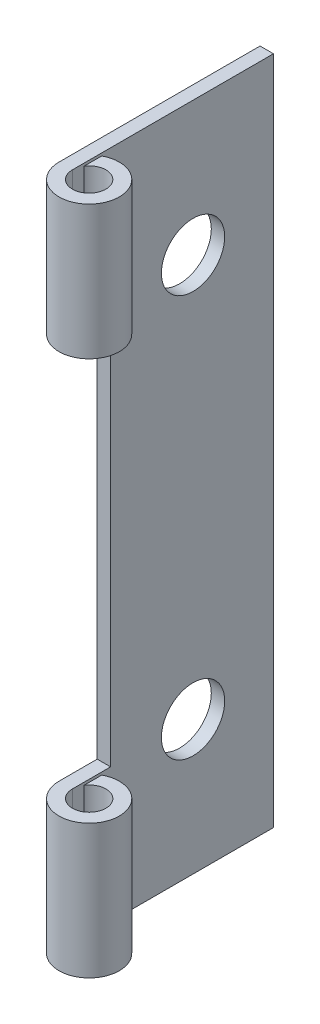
ISO-10303-21;
HEADER;
FILE_DESCRIPTION(('STEP AP214'),'2;1');
FILE_NAME('part.step','',(''),(''),'','','');
FILE_SCHEMA(('AUTOMOTIVE_DESIGN { 1 0 10303 214 1 1 1 1 }'));
ENDSEC;
DATA;
#1=APPLICATION_CONTEXT('core data for automotive mechanical design processes');
#2=APPLICATION_PROTOCOL_DEFINITION('international standard','automotive_design',2000,#1);
#3=PRODUCT_CONTEXT('',#1,'mechanical');
#4=PRODUCT('Part','Part','',(#3));
#5=PRODUCT_RELATED_PRODUCT_CATEGORY('part','',(#4));
#6=PRODUCT_DEFINITION_FORMATION('','',#4);
#7=PRODUCT_DEFINITION_CONTEXT('part definition',#1,'design');
#8=PRODUCT_DEFINITION('design','',#6,#7);
#9=PRODUCT_DEFINITION_SHAPE('','',#8);
#10=(LENGTH_UNIT() NAMED_UNIT(*) SI_UNIT(.MILLI.,.METRE.));
#11=(NAMED_UNIT(*) PLANE_ANGLE_UNIT() SI_UNIT($,.RADIAN.));
#12=(NAMED_UNIT(*) SI_UNIT($,.STERADIAN.) SOLID_ANGLE_UNIT());
#13=UNCERTAINTY_MEASURE_WITH_UNIT(LENGTH_MEASURE(1.E-05),#10,'distance_accuracy_value','');
#14=(GEOMETRIC_REPRESENTATION_CONTEXT(3) GLOBAL_UNCERTAINTY_ASSIGNED_CONTEXT((#13)) GLOBAL_UNIT_ASSIGNED_CONTEXT((#10,
#11,#12)) REPRESENTATION_CONTEXT('',''));
#15=CARTESIAN_POINT('',(0.,0.,0.));
#16=DIRECTION('',(0.,0.,1.));
#17=DIRECTION('',(1.,0.,0.));
#18=AXIS2_PLACEMENT_3D('',#15,#16,#17);
#19=CARTESIAN_POINT('',(0.635,31.75,-9.525));
#20=DIRECTION('',(-1.,0.,0.));
#21=DIRECTION('',(0.,0.,1.));
#22=AXIS2_PLACEMENT_3D('',#19,#20,#21);
#23=PLANE('',#22);
#24=CARTESIAN_POINT('',(0.635,6.35,-5.715));
#25=DIRECTION('',(1.,0.,0.));
#26=DIRECTION('',(0.,0.,-1.));
#27=AXIS2_PLACEMENT_3D('',#24,#25,#26);
#28=CIRCLE('',#27,1.5);
#29=CARTESIAN_POINT('',(0.635,6.35,-7.215));
#30=VERTEX_POINT('',#29);
#31=EDGE_CURVE('E226',#30,#30,#28,.T.);
#32=ORIENTED_EDGE('',*,*,#31,.F.);
#33=EDGE_LOOP('',(#32));
#34=FACE_BOUND('',#33,.T.);
#35=CARTESIAN_POINT('',(0.635,25.4,-5.715));
#36=DIRECTION('',(1.,0.,0.));
#37=DIRECTION('',(0.,0.,-1.));
#38=AXIS2_PLACEMENT_3D('',#35,#36,#37);
#39=CIRCLE('',#38,1.5);
#40=CARTESIAN_POINT('',(0.635,25.4,-7.215));
#41=VERTEX_POINT('',#40);
#42=EDGE_CURVE('E221',#41,#41,#39,.T.);
#43=ORIENTED_EDGE('',*,*,#42,.F.);
#44=EDGE_LOOP('',(#43));
#45=FACE_BOUND('',#44,.T.);
#46=DIRECTION('',(0.,0.,1.));
#47=VECTOR('',#46,1.);
#48=CARTESIAN_POINT('',(0.635,25.4,-9.525));
#49=LINE('',#48,#47);
#50=CARTESIAN_POINT('',(0.635,25.4,-1.80975));
#51=VERTEX_POINT('',#50);
#52=CARTESIAN_POINT('',(0.635,25.4,0.));
#53=VERTEX_POINT('',#52);
#54=EDGE_CURVE('E61',#51,#53,#49,.T.);
#55=ORIENTED_EDGE('',*,*,#54,.F.);
#56=DIRECTION('',(0.,1.,0.));
#57=VECTOR('',#56,1.);
#58=CARTESIAN_POINT('',(0.635,31.75,-1.80975));
#59=LINE('',#58,#57);
#60=CARTESIAN_POINT('',(0.635,6.35,-1.80975));
#61=VERTEX_POINT('',#60);
#62=EDGE_CURVE('E149',#61,#51,#59,.T.);
#63=ORIENTED_EDGE('',*,*,#62,.F.);
#64=DIRECTION('',(0.,0.,-1.));
#65=VECTOR('',#64,1.);
#66=CARTESIAN_POINT('',(0.635,6.35,-9.52500000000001));
#67=LINE('',#66,#65);
#68=CARTESIAN_POINT('',(0.635,6.35,0.));
#69=VERTEX_POINT('',#68);
#70=EDGE_CURVE('E194',#69,#61,#67,.T.);
#71=ORIENTED_EDGE('',*,*,#70,.F.);
#72=DIRECTION('',(0.,-1.,0.));
#73=VECTOR('',#72,1.);
#74=CARTESIAN_POINT('',(0.635,31.75,0.));
#75=LINE('',#74,#73);
#76=CARTESIAN_POINT('',(0.635,0.,0.));
#77=VERTEX_POINT('',#76);
#78=EDGE_CURVE('E98',#69,#77,#75,.T.);
#79=ORIENTED_EDGE('',*,*,#78,.T.);
#80=DIRECTION('',(0.,0.,-1.));
#81=VECTOR('',#80,1.);
#82=CARTESIAN_POINT('',(0.635,0.,-9.525));
#83=LINE('',#82,#81);
#84=CARTESIAN_POINT('',(0.635,0.,-9.525));
#85=VERTEX_POINT('',#84);
#86=EDGE_CURVE('E145',#77,#85,#83,.T.);
#87=ORIENTED_EDGE('',*,*,#86,.T.);
#88=DIRECTION('',(0.,-1.,0.));
#89=VECTOR('',#88,1.);
#90=CARTESIAN_POINT('',(0.635,31.75,-9.525));
#91=LINE('',#90,#89);
#92=CARTESIAN_POINT('',(0.635,31.75,-9.525));
#93=VERTEX_POINT('',#92);
#94=EDGE_CURVE('E172',#93,#85,#91,.T.);
#95=ORIENTED_EDGE('',*,*,#94,.F.);
#96=DIRECTION('',(0.,0.,-1.));
#97=VECTOR('',#96,1.);
#98=CARTESIAN_POINT('',(0.635,31.75,-9.525));
#99=LINE('',#98,#97);
#100=CARTESIAN_POINT('',(0.635,31.75,0.));
#101=VERTEX_POINT('',#100);
#102=EDGE_CURVE('E104',#101,#93,#99,.T.);
#103=ORIENTED_EDGE('',*,*,#102,.F.);
#104=EDGE_CURVE('E162',#101,#53,#75,.T.);
#105=ORIENTED_EDGE('',*,*,#104,.T.);
#106=EDGE_LOOP('',(#55,#63,#71,#79,#87,#95,#103,#105));
#107=FACE_BOUND('',#106,.T.);
#108=ADVANCED_FACE('F47',(#34,#45,#107),#23,.F.);
#109=CARTESIAN_POINT('',(0.,31.75,-9.525));
#110=DIRECTION('',(1.,0.,0.));
#111=DIRECTION('',(0.,0.,-1.));
#112=AXIS2_PLACEMENT_3D('',#109,#110,#111);
#113=PLANE('',#112);
#114=CARTESIAN_POINT('',(0.,6.35,-5.715));
#115=DIRECTION('',(1.,0.,0.));
#116=DIRECTION('',(0.,0.,-1.));
#117=AXIS2_PLACEMENT_3D('',#114,#115,#116);
#118=CIRCLE('',#117,1.5);
#119=CARTESIAN_POINT('',(0.,6.35,-7.215));
#120=VERTEX_POINT('',#119);
#121=EDGE_CURVE('E211',#120,#120,#118,.T.);
#122=ORIENTED_EDGE('',*,*,#121,.T.);
#123=EDGE_LOOP('',(#122));
#124=FACE_BOUND('',#123,.T.);
#125=CARTESIAN_POINT('',(0.,25.4,-5.715));
#126=DIRECTION('',(1.,0.,0.));
#127=DIRECTION('',(0.,0.,-1.));
#128=AXIS2_PLACEMENT_3D('',#125,#126,#127);
#129=CIRCLE('',#128,1.5);
#130=CARTESIAN_POINT('',(0.,25.4,-7.215));
#131=VERTEX_POINT('',#130);
#132=EDGE_CURVE('E219',#131,#131,#129,.T.);
#133=ORIENTED_EDGE('',*,*,#132,.T.);
#134=EDGE_LOOP('',(#133));
#135=FACE_BOUND('',#134,.T.);
#136=DIRECTION('',(0.,1.,0.));
#137=VECTOR('',#136,1.);
#138=CARTESIAN_POINT('',(0.,12.7,-1.80975));
#139=LINE('',#138,#137);
#140=CARTESIAN_POINT('',(0.,6.35,-1.80975));
#141=VERTEX_POINT('',#140);
#142=CARTESIAN_POINT('',(0.,25.4,-1.80975));
#143=VERTEX_POINT('',#142);
#144=EDGE_CURVE('E214',#141,#143,#139,.T.);
#145=ORIENTED_EDGE('',*,*,#144,.T.);
#146=DIRECTION('',(0.,0.,1.));
#147=VECTOR('',#146,1.);
#148=CARTESIAN_POINT('',(0.,25.4,1.80975));
#149=LINE('',#148,#147);
#150=CARTESIAN_POINT('',(0.,25.4,0.));
#151=VERTEX_POINT('',#150);
#152=EDGE_CURVE('E208',#143,#151,#149,.T.);
#153=ORIENTED_EDGE('',*,*,#152,.T.);
#154=DIRECTION('',(0.,-1.,0.));
#155=VECTOR('',#154,1.);
#156=CARTESIAN_POINT('',(0.,31.75,0.));
#157=LINE('',#156,#155);
#158=CARTESIAN_POINT('',(0.,31.75,0.));
#159=VERTEX_POINT('',#158);
#160=EDGE_CURVE('E167',#159,#151,#157,.T.);
#161=ORIENTED_EDGE('',*,*,#160,.F.);
#162=DIRECTION('',(0.,0.,1.));
#163=VECTOR('',#162,1.);
#164=CARTESIAN_POINT('',(0.,31.75,-9.525));
#165=LINE('',#164,#163);
#166=CARTESIAN_POINT('',(0.,31.75,-9.525));
#167=VERTEX_POINT('',#166);
#168=EDGE_CURVE('E121',#167,#159,#165,.T.);
#169=ORIENTED_EDGE('',*,*,#168,.F.);
#170=DIRECTION('',(0.,-1.,0.));
#171=VECTOR('',#170,1.);
#172=CARTESIAN_POINT('',(0.,31.75,-9.525));
#173=LINE('',#172,#171);
#174=CARTESIAN_POINT('',(0.,0.,-9.525));
#175=VERTEX_POINT('',#174);
#176=EDGE_CURVE('E169',#167,#175,#173,.T.);
#177=ORIENTED_EDGE('',*,*,#176,.T.);
#178=DIRECTION('',(0.,0.,1.));
#179=VECTOR('',#178,1.);
#180=CARTESIAN_POINT('',(0.,0.,-9.525));
#181=LINE('',#180,#179);
#182=CARTESIAN_POINT('',(0.,0.,0.));
#183=VERTEX_POINT('',#182);
#184=EDGE_CURVE('E151',#175,#183,#181,.T.);
#185=ORIENTED_EDGE('',*,*,#184,.T.);
#186=CARTESIAN_POINT('',(0.,6.35,0.));
#187=VERTEX_POINT('',#186);
#188=EDGE_CURVE('E135',#187,#183,#157,.T.);
#189=ORIENTED_EDGE('',*,*,#188,.F.);
#190=DIRECTION('',(0.,0.,-1.));
#191=VECTOR('',#190,1.);
#192=CARTESIAN_POINT('',(0.,6.35,1.80975));
#193=LINE('',#192,#191);
#194=EDGE_CURVE('E207',#187,#141,#193,.T.);
#195=ORIENTED_EDGE('',*,*,#194,.T.);
#196=EDGE_LOOP('',(#145,#153,#161,#169,#177,#185,#189,#195));
#197=FACE_BOUND('',#196,.T.);
#198=ADVANCED_FACE('F234',(#124,#135,#197),#113,.F.);
#199=CARTESIAN_POINT('',(1.42875,31.75,0.));
#200=DIRECTION('',(0.,-1.,0.));
#201=DIRECTION('',(0.,0.,-1.));
#202=AXIS2_PLACEMENT_3D('',#199,#200,#201);
#203=CYLINDRICAL_SURFACE('',#202,1.42875);
#204=DIRECTION('',(0.,-1.,0.));
#205=VECTOR('',#204,1.);
#206=CARTESIAN_POINT('',(0.762,31.75,-1.26363404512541));
#207=LINE('',#206,#205);
#208=CARTESIAN_POINT('',(0.762000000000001,6.35,-1.26363404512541));
#209=VERTEX_POINT('',#208);
#210=CARTESIAN_POINT('',(0.762,0.,-1.26363404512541));
#211=VERTEX_POINT('',#210);
#212=EDGE_CURVE('E136',#209,#211,#207,.T.);
#213=ORIENTED_EDGE('',*,*,#212,.F.);
#214=CARTESIAN_POINT('',(1.42875,6.35,0.));
#215=DIRECTION('',(0.,1.,0.));
#216=DIRECTION('',(0.,0.,1.));
#217=AXIS2_PLACEMENT_3D('',#214,#215,#216);
#218=CIRCLE('',#217,1.42875);
#219=EDGE_CURVE('E193',#187,#209,#218,.T.);
#220=ORIENTED_EDGE('',*,*,#219,.F.);
#221=ORIENTED_EDGE('',*,*,#188,.T.);
#222=CARTESIAN_POINT('',(1.42875,0.,0.));
#223=DIRECTION('',(0.,1.,0.));
#224=DIRECTION('',(0.,0.,1.));
#225=AXIS2_PLACEMENT_3D('',#222,#223,#224);
#226=CIRCLE('',#225,1.42875);
#227=EDGE_CURVE('E154',#183,#211,#226,.T.);
#228=ORIENTED_EDGE('',*,*,#227,.T.);
#229=EDGE_LOOP('',(#213,#220,#221,#228));
#230=FACE_BOUND('',#229,.T.);
#231=ADVANCED_FACE('F280',(#230),#203,.T.);
#232=ORIENTED_EDGE('',*,*,#160,.T.);
#233=CARTESIAN_POINT('',(1.42875,25.4,0.));
#234=DIRECTION('',(0.,-1.,0.));
#235=DIRECTION('',(0.,0.,-1.));
#236=AXIS2_PLACEMENT_3D('',#233,#234,#235);
#237=CIRCLE('',#236,1.42875);
#238=CARTESIAN_POINT('',(0.762000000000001,25.4,-1.26363404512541));
#239=VERTEX_POINT('',#238);
#240=EDGE_CURVE('E132',#239,#151,#237,.T.);
#241=ORIENTED_EDGE('',*,*,#240,.F.);
#242=CARTESIAN_POINT('',(0.762,31.75,-1.26363404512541));
#243=VERTEX_POINT('',#242);
#244=EDGE_CURVE('E128',#243,#239,#207,.T.);
#245=ORIENTED_EDGE('',*,*,#244,.F.);
#246=CARTESIAN_POINT('',(1.42875,31.75,0.));
#247=DIRECTION('',(0.,1.,0.));
#248=DIRECTION('',(0.,0.,1.));
#249=AXIS2_PLACEMENT_3D('',#246,#247,#248);
#250=CIRCLE('',#249,1.42875);
#251=EDGE_CURVE('E114',#159,#243,#250,.T.);
#252=ORIENTED_EDGE('',*,*,#251,.F.);
#253=EDGE_LOOP('',(#232,#241,#245,#252));
#254=FACE_BOUND('',#253,.T.);
#255=ADVANCED_FACE('F129',(#254),#203,.T.);
#256=CARTESIAN_POINT('',(0.762000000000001,31.75,-1.26363404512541));
#257=DIRECTION('',(1.,0.,0.));
#258=DIRECTION('',(0.,0.,-1.));
#259=AXIS2_PLACEMENT_3D('',#256,#257,#258);
#260=PLANE('',#259);
#261=DIRECTION('',(0.,0.,1.));
#262=VECTOR('',#261,1.);
#263=CARTESIAN_POINT('',(0.762000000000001,6.35,-1.26363404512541));
#264=LINE('',#263,#262);
#265=CARTESIAN_POINT('',(0.762000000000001,6.35,-0.430677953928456));
#266=VERTEX_POINT('',#265);
#267=EDGE_CURVE('E197',#209,#266,#264,.T.);
#268=ORIENTED_EDGE('',*,*,#267,.F.);
#269=ORIENTED_EDGE('',*,*,#212,.T.);
#270=DIRECTION('',(0.,0.,1.));
#271=VECTOR('',#270,1.);
#272=CARTESIAN_POINT('',(0.762000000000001,0.,-1.26363404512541));
#273=LINE('',#272,#271);
#274=CARTESIAN_POINT('',(0.762000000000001,0.,-0.430677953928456));
#275=VERTEX_POINT('',#274);
#276=EDGE_CURVE('E157',#211,#275,#273,.T.);
#277=ORIENTED_EDGE('',*,*,#276,.T.);
#278=DIRECTION('',(0.,-1.,0.));
#279=VECTOR('',#278,1.);
#280=CARTESIAN_POINT('',(0.762000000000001,31.75,-0.430677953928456));
#281=LINE('',#280,#279);
#282=EDGE_CURVE('E165',#266,#275,#281,.T.);
#283=ORIENTED_EDGE('',*,*,#282,.F.);
#284=EDGE_LOOP('',(#268,#269,#277,#283));
#285=FACE_BOUND('',#284,.T.);
#286=ADVANCED_FACE('F276',(#285),#260,.F.);
#287=DIRECTION('',(0.,0.,-1.));
#288=VECTOR('',#287,1.);
#289=CARTESIAN_POINT('',(0.762000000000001,25.4,-1.26363404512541));
#290=LINE('',#289,#288);
#291=CARTESIAN_POINT('',(0.762000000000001,25.4,-0.430677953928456));
#292=VERTEX_POINT('',#291);
#293=EDGE_CURVE('E177',#292,#239,#290,.T.);
#294=ORIENTED_EDGE('',*,*,#293,.F.);
#295=CARTESIAN_POINT('',(0.762000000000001,31.75,-0.430677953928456));
#296=VERTEX_POINT('',#295);
#297=EDGE_CURVE('E140',#296,#292,#281,.T.);
#298=ORIENTED_EDGE('',*,*,#297,.F.);
#299=DIRECTION('',(0.,0.,1.));
#300=VECTOR('',#299,1.);
#301=CARTESIAN_POINT('',(0.762000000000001,31.75,-1.26363404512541));
#302=LINE('',#301,#300);
#303=EDGE_CURVE('E118',#243,#296,#302,.T.);
#304=ORIENTED_EDGE('',*,*,#303,.F.);
#305=ORIENTED_EDGE('',*,*,#244,.T.);
#306=EDGE_LOOP('',(#294,#298,#304,#305));
#307=FACE_BOUND('',#306,.T.);
#308=ADVANCED_FACE('F138',(#307),#260,.F.);
#309=CARTESIAN_POINT('',(1.42875,31.75,0.));
#310=DIRECTION('',(0.,-1.,0.));
#311=DIRECTION('',(0.,0.,-1.));
#312=AXIS2_PLACEMENT_3D('',#309,#310,#311);
#313=CYLINDRICAL_SURFACE('',#312,0.79375);
#314=CARTESIAN_POINT('',(1.42875,6.35,0.));
#315=DIRECTION('',(0.,1.,0.));
#316=DIRECTION('',(0.,0.,1.));
#317=AXIS2_PLACEMENT_3D('',#314,#315,#316);
#318=CIRCLE('',#317,0.79375);
#319=EDGE_CURVE('E12',#266,#69,#318,.F.);
#320=ORIENTED_EDGE('',*,*,#319,.F.);
#321=ORIENTED_EDGE('',*,*,#282,.T.);
#322=CARTESIAN_POINT('',(1.42875,0.,0.));
#323=DIRECTION('',(0.,-1.,0.));
#324=DIRECTION('',(0.,0.,1.));
#325=AXIS2_PLACEMENT_3D('',#322,#323,#324);
#326=CIRCLE('',#325,0.79375);
#327=EDGE_CURVE('E160',#275,#77,#326,.T.);
#328=ORIENTED_EDGE('',*,*,#327,.T.);
#329=ORIENTED_EDGE('',*,*,#78,.F.);
#330=EDGE_LOOP('',(#320,#321,#328,#329));
#331=FACE_BOUND('',#330,.T.);
#332=ADVANCED_FACE('F272',(#331),#313,.F.);
#333=CARTESIAN_POINT('',(1.42875,25.4,0.));
#334=DIRECTION('',(0.,-1.,0.));
#335=DIRECTION('',(0.,0.,-1.));
#336=AXIS2_PLACEMENT_3D('',#333,#334,#335);
#337=CIRCLE('',#336,0.79375);
#338=EDGE_CURVE('E54',#53,#292,#337,.F.);
#339=ORIENTED_EDGE('',*,*,#338,.F.);
#340=ORIENTED_EDGE('',*,*,#104,.F.);
#341=CARTESIAN_POINT('',(1.42875,31.75,0.));
#342=DIRECTION('',(0.,-1.,0.));
#343=DIRECTION('',(0.,0.,1.));
#344=AXIS2_PLACEMENT_3D('',#341,#342,#343);
#345=CIRCLE('',#344,0.79375);
#346=EDGE_CURVE('E70',#296,#101,#345,.T.);
#347=ORIENTED_EDGE('',*,*,#346,.F.);
#348=ORIENTED_EDGE('',*,*,#297,.T.);
#349=EDGE_LOOP('',(#339,#340,#347,#348));
#350=FACE_BOUND('',#349,.T.);
#351=ADVANCED_FACE('F183',(#350),#313,.F.);
#352=CARTESIAN_POINT('',(0.635,31.75,-9.525));
#353=DIRECTION('',(0.,0.,1.));
#354=DIRECTION('',(1.,0.,0.));
#355=AXIS2_PLACEMENT_3D('',#352,#353,#354);
#356=PLANE('',#355);
#357=DIRECTION('',(-1.,0.,0.));
#358=VECTOR('',#357,1.);
#359=CARTESIAN_POINT('',(0.635,0.,-9.525));
#360=LINE('',#359,#358);
#361=EDGE_CURVE('E148',#85,#175,#360,.T.);
#362=ORIENTED_EDGE('',*,*,#361,.T.);
#363=ORIENTED_EDGE('',*,*,#176,.F.);
#364=DIRECTION('',(-1.,0.,0.));
#365=VECTOR('',#364,1.);
#366=CARTESIAN_POINT('',(0.635,31.75,-9.525));
#367=LINE('',#366,#365);
#368=EDGE_CURVE('E186',#93,#167,#367,.T.);
#369=ORIENTED_EDGE('',*,*,#368,.F.);
#370=ORIENTED_EDGE('',*,*,#94,.T.);
#371=EDGE_LOOP('',(#362,#363,#369,#370));
#372=FACE_BOUND('',#371,.T.);
#373=ADVANCED_FACE('F268',(#372),#356,.F.);
#374=CARTESIAN_POINT('',(1.42875,31.75,0.));
#375=DIRECTION('',(0.,1.,0.));
#376=DIRECTION('',(0.,0.,1.));
#377=AXIS2_PLACEMENT_3D('',#374,#375,#376);
#378=PLANE('',#377);
#379=ORIENTED_EDGE('',*,*,#168,.T.);
#380=ORIENTED_EDGE('',*,*,#251,.T.);
#381=ORIENTED_EDGE('',*,*,#303,.T.);
#382=ORIENTED_EDGE('',*,*,#346,.T.);
#383=ORIENTED_EDGE('',*,*,#102,.T.);
#384=ORIENTED_EDGE('',*,*,#368,.T.);
#385=EDGE_LOOP('',(#379,#380,#381,#382,#383,#384));
#386=FACE_BOUND('',#385,.T.);
#387=ADVANCED_FACE('F116',(#386),#378,.T.);
#388=CARTESIAN_POINT('',(1.42875,0.,0.));
#389=DIRECTION('',(0.,1.,0.));
#390=DIRECTION('',(0.,0.,1.));
#391=AXIS2_PLACEMENT_3D('',#388,#389,#390);
#392=PLANE('',#391);
#393=ORIENTED_EDGE('',*,*,#86,.F.);
#394=ORIENTED_EDGE('',*,*,#327,.F.);
#395=ORIENTED_EDGE('',*,*,#276,.F.);
#396=ORIENTED_EDGE('',*,*,#227,.F.);
#397=ORIENTED_EDGE('',*,*,#184,.F.);
#398=ORIENTED_EDGE('',*,*,#361,.F.);
#399=EDGE_LOOP('',(#393,#394,#395,#396,#397,#398));
#400=FACE_BOUND('',#399,.T.);
#401=ADVANCED_FACE('F265',(#400),#392,.F.);
#402=CARTESIAN_POINT('',(2.8575,25.4,1.80975));
#403=DIRECTION('',(0.,-1.,0.));
#404=DIRECTION('',(0.,0.,-1.));
#405=AXIS2_PLACEMENT_3D('',#402,#403,#404);
#406=PLANE('',#405);
#407=ORIENTED_EDGE('',*,*,#54,.T.);
#408=ORIENTED_EDGE('',*,*,#338,.T.);
#409=ORIENTED_EDGE('',*,*,#293,.T.);
#410=ORIENTED_EDGE('',*,*,#240,.T.);
#411=ORIENTED_EDGE('',*,*,#152,.F.);
#412=DIRECTION('',(-1.,0.,0.));
#413=VECTOR('',#412,1.);
#414=CARTESIAN_POINT('',(2.8575,25.4,-1.80975));
#415=LINE('',#414,#413);
#416=EDGE_CURVE('E204',#51,#143,#415,.T.);
#417=ORIENTED_EDGE('',*,*,#416,.F.);
#418=EDGE_LOOP('',(#407,#408,#409,#410,#411,#417));
#419=FACE_BOUND('',#418,.T.);
#420=ADVANCED_FACE('F176',(#419),#406,.T.);
#421=CARTESIAN_POINT('',(2.8575,12.7,-1.80975));
#422=DIRECTION('',(0.,0.,1.));
#423=DIRECTION('',(0.,-1.,0.));
#424=AXIS2_PLACEMENT_3D('',#421,#422,#423);
#425=PLANE('',#424);
#426=ORIENTED_EDGE('',*,*,#62,.T.);
#427=ORIENTED_EDGE('',*,*,#416,.T.);
#428=ORIENTED_EDGE('',*,*,#144,.F.);
#429=DIRECTION('',(-1.,0.,0.));
#430=VECTOR('',#429,1.);
#431=CARTESIAN_POINT('',(2.8575,6.35,-1.80975));
#432=LINE('',#431,#430);
#433=EDGE_CURVE('E181',#61,#141,#432,.T.);
#434=ORIENTED_EDGE('',*,*,#433,.F.);
#435=EDGE_LOOP('',(#426,#427,#428,#434));
#436=FACE_BOUND('',#435,.T.);
#437=ADVANCED_FACE('F255',(#436),#425,.T.);
#438=CARTESIAN_POINT('',(2.8575,6.35,1.80975));
#439=DIRECTION('',(0.,1.,0.));
#440=DIRECTION('',(0.,0.,1.));
#441=AXIS2_PLACEMENT_3D('',#438,#439,#440);
#442=PLANE('',#441);
#443=ORIENTED_EDGE('',*,*,#219,.T.);
#444=ORIENTED_EDGE('',*,*,#267,.T.);
#445=ORIENTED_EDGE('',*,*,#319,.T.);
#446=ORIENTED_EDGE('',*,*,#70,.T.);
#447=ORIENTED_EDGE('',*,*,#433,.T.);
#448=ORIENTED_EDGE('',*,*,#194,.F.);
#449=EDGE_LOOP('',(#443,#444,#445,#446,#447,#448));
#450=FACE_BOUND('',#449,.T.);
#451=ADVANCED_FACE('F249',(#450),#442,.T.);
#452=CARTESIAN_POINT('',(0.,25.4,-5.715));
#453=DIRECTION('',(1.,0.,0.));
#454=DIRECTION('',(0.,0.,-1.));
#455=AXIS2_PLACEMENT_3D('',#452,#453,#454);
#456=CYLINDRICAL_SURFACE('',#455,1.5);
#457=ORIENTED_EDGE('',*,*,#132,.F.);
#458=EDGE_LOOP('',(#457));
#459=FACE_BOUND('',#458,.T.);
#460=ORIENTED_EDGE('',*,*,#42,.T.);
#461=EDGE_LOOP('',(#460));
#462=FACE_BOUND('',#461,.T.);
#463=ADVANCED_FACE('F240',(#459,#462),#456,.F.);
#464=CARTESIAN_POINT('',(0.,6.35,-5.715));
#465=DIRECTION('',(1.,0.,0.));
#466=DIRECTION('',(0.,0.,-1.));
#467=AXIS2_PLACEMENT_3D('',#464,#465,#466);
#468=CYLINDRICAL_SURFACE('',#467,1.5);
#469=ORIENTED_EDGE('',*,*,#121,.F.);
#470=EDGE_LOOP('',(#469));
#471=FACE_BOUND('',#470,.T.);
#472=ORIENTED_EDGE('',*,*,#31,.T.);
#473=EDGE_LOOP('',(#472));
#474=FACE_BOUND('',#473,.T.);
#475=ADVANCED_FACE('F237',(#471,#474),#468,.F.);
#476=CLOSED_SHELL('',(#108,#198,#231,#255,#286,#308,#332,#351,#373,#387,#401,#420,#437,#451,
#463,#475));
#477=MANIFOLD_SOLID_BREP('B2',#476);
#478=ADVANCED_BREP_SHAPE_REPRESENTATION('',(#18,#477),#14);
#479=SHAPE_DEFINITION_REPRESENTATION(#9,#478);
ENDSEC;
END-ISO-10303-21;
